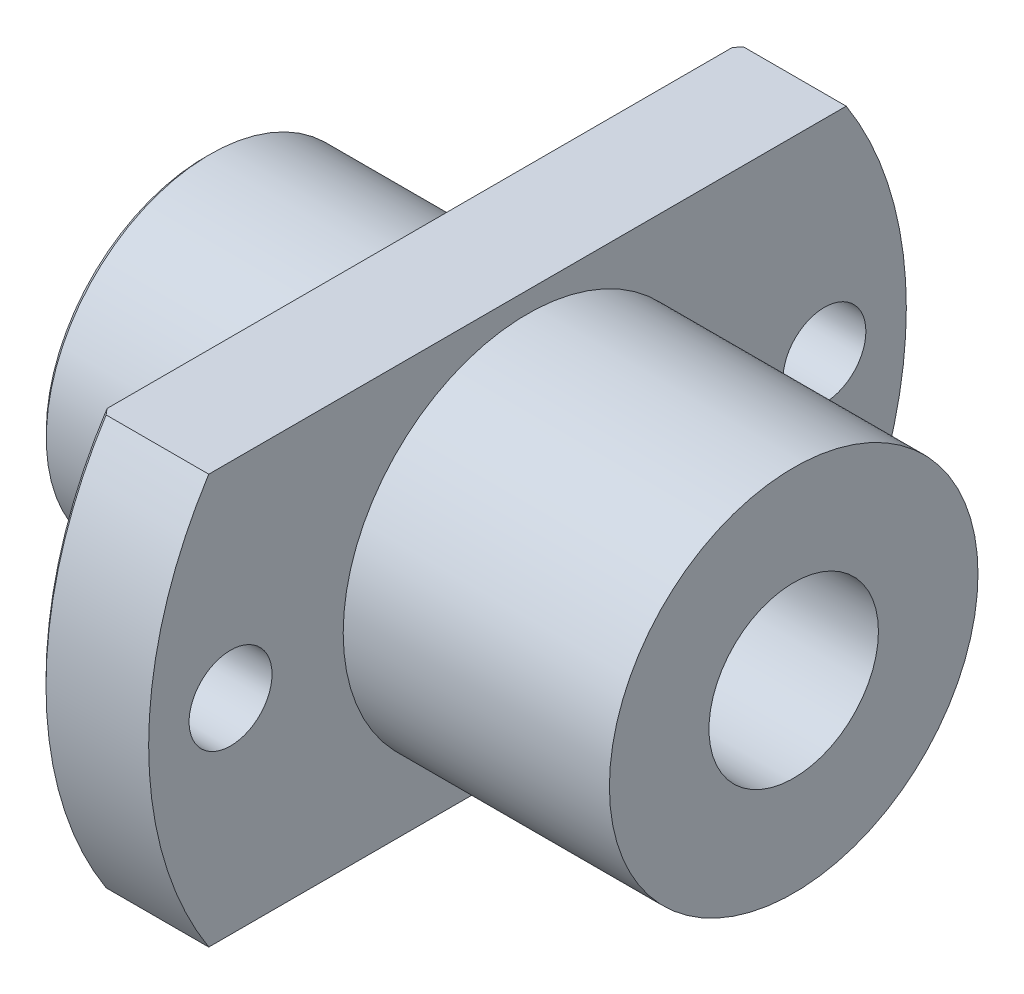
from build123d import *

# Parameters (mm, degrees)
ESQUISSE2_W                         = 60
ESQUISSE2_H                         = 40
ESQUISSE9_R                         = 8.275
ENL_V_MAT_EXTRU_1_DEPTH             = 82.737384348
CHANFREIN1_SIZE                     = 0.2
CHANFREIN2_SIZE                     = 0.5
CONG_1_R                            = 0.4
CHANFREIN3_SIZE                     = 0.5
ESQUISSE11_W                        = 73.119683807
ESQUISSE11_H                        = 21.175427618
ESQUISSE11_W_2                      = 83.907314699
ESQUISSE11_H_2                      = 21.458420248
ENL_V_MAT_EXTRU_2_DEPTH             = 64.81281709
DIAM_TRE_DU_PER_AGE_8_1_8_1_1_D     = 8.1
DIAM_TRE_DU_PER_AGE_8_1_8_1_1_DEPTH = 12
DIAM_TRE_DU_PER_AGE_8_1_8_1_1_TIP   = 4.05
CHANFREIN4_SIZE                     = 0.2


with BuildPart() as part:
    # Esquisse2 → R_volution1 (revolve)
    with BuildSketch(Plane.XY, mode=Mode.PRIVATE) as r_volution1_sk:
        with Locations((30, 20)):
            Rectangle(ESQUISSE2_W, ESQUISSE2_H)
    revolve(r_volution1_sk.sketch.rotate(Axis((-39.971867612, 0, 0), (1, 0, 0)), 90), axis=Axis((-39.971867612, 0, 0), (1, 0, 0)))

    # Esquisse8 → Enl_vement de mati_re-R_volution2 (revolve, cut)
    with BuildSketch(Plane.XY, mode=Mode.PRIVATE) as enl_vement_de_mati_re_r_volution2_sk:
        Polygon((33, 46.031040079), (33, 18), (59, 18), (59, 0), (67.631007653, 0), (67.631007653, 50.322917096), align=None)
    revolve(enl_vement_de_mati_re_r_volution2_sk.sketch.rotate(Axis((-12.510753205, 0, 0), (1, 0, 0)), 90), axis=Axis((-12.510753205, 0, 0), (1, 0, 0)), mode=Mode.SUBTRACT)

    # Esquisse9 → Enl_v. mat.-Extru.1 (cut, through all)
    with BuildSketch(Plane(origin=(59, 0, 0), x_dir=(0, 0, -1), z_dir=(1, 0, 0))):
        Circle(ESQUISSE9_R)
    extrude(amount=-ENL_V_MAT_EXTRU_1_DEPTH, mode=Mode.SUBTRACT)

    # Esquisse10 → Enl_vement de mati_re-R_volution3 (revolve, cut)
    with BuildSketch(Plane.XY, mode=Mode.PRIVATE) as enl_vement_de_mati_re_r_volution3_sk:
        Polygon((35.312821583, 37), (22.475, 37), (22.475, 16), (1.5, 16), (1.5, 9.01), (16.5, 9.01), (16.5, 0), (-6.906619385, 0), (-6.906619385, 43.749130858), (35.312821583, 43.749130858), align=None)
    revolve(enl_vement_de_mati_re_r_volution3_sk.sketch.rotate(Axis((71.872409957, 0, 0), (-1, 0, 0)), 90), axis=Axis((71.872409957, 0, 0), (-1, 0, 0)), mode=Mode.SUBTRACT)

    # Chanfrein1
    chanfrein1_edges = [part.edges().sort_by_distance(p)[0] for p in [
        (16.5, 0, 8.275),
        (1.5, 0, 9.01),
    ]]
    chamfer(chanfrein1_edges, length=CHANFREIN1_SIZE)

    # Chanfrein2
    chanfrein2_edges = [part.edges().sort_by_distance(p)[0] for p in [
        (1.5, 0, 16),
    ]]
    chamfer(chanfrein2_edges, length=CHANFREIN2_SIZE)

    # Cong_1
    cong_1_edges = [part.edges().sort_by_distance(p)[0] for p in [
        (22.475, 0, 16),
    ]]
    fillet(cong_1_edges, radius=CONG_1_R)

    # Chanfrein3
    chanfrein3_edges = [part.edges().sort_by_distance(p)[0] for p in [
        (22.475, 0, 37),
    ]]
    chamfer(chanfrein3_edges, length=CHANFREIN3_SIZE)

    # Esquisse11 → Enl_v. mat.-Extru.2 (cut, through all)
    with BuildSketch(Plane.ZY.offset(-22.475)):
        with Locations((2.034741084, 30.587713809)):
            Rectangle(ESQUISSE11_W, ESQUISSE11_H)
        with Locations((2.900674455, -30.729210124)):
            Rectangle(ESQUISSE11_W_2, ESQUISSE11_H_2)
    extrude(amount=-ENL_V_MAT_EXTRU_2_DEPTH, mode=Mode.SUBTRACT)

    # Diam_tre du per_age _8.1 _8.1_1
    with Locations(Plane(origin=(22.475, 0, -29), x_dir=(0, 0, -1), z_dir=(-1, 0, 0))):
        with Locations((0, 0), (-58, 0)):
            Hole(DIAM_TRE_DU_PER_AGE_8_1_8_1_1_D / 2, depth=DIAM_TRE_DU_PER_AGE_8_1_8_1_1_DEPTH)
            with Locations((0, 0, -(DIAM_TRE_DU_PER_AGE_8_1_8_1_1_DEPTH + DIAM_TRE_DU_PER_AGE_8_1_8_1_1_TIP / 2))):  # 90° drill point
                Cone(0, DIAM_TRE_DU_PER_AGE_8_1_8_1_1_D / 2, DIAM_TRE_DU_PER_AGE_8_1_8_1_1_TIP, mode=Mode.SUBTRACT)

    # Chanfrein4
    chanfrein4_edges = [part.edges().sort_by_distance(p)[0] for p in [
        (22.475, 0, 24.95),
        (22.475, 0, -33.05),
    ]]
    chamfer(chanfrein4_edges, length=CHANFREIN4_SIZE)


solid = part.part
